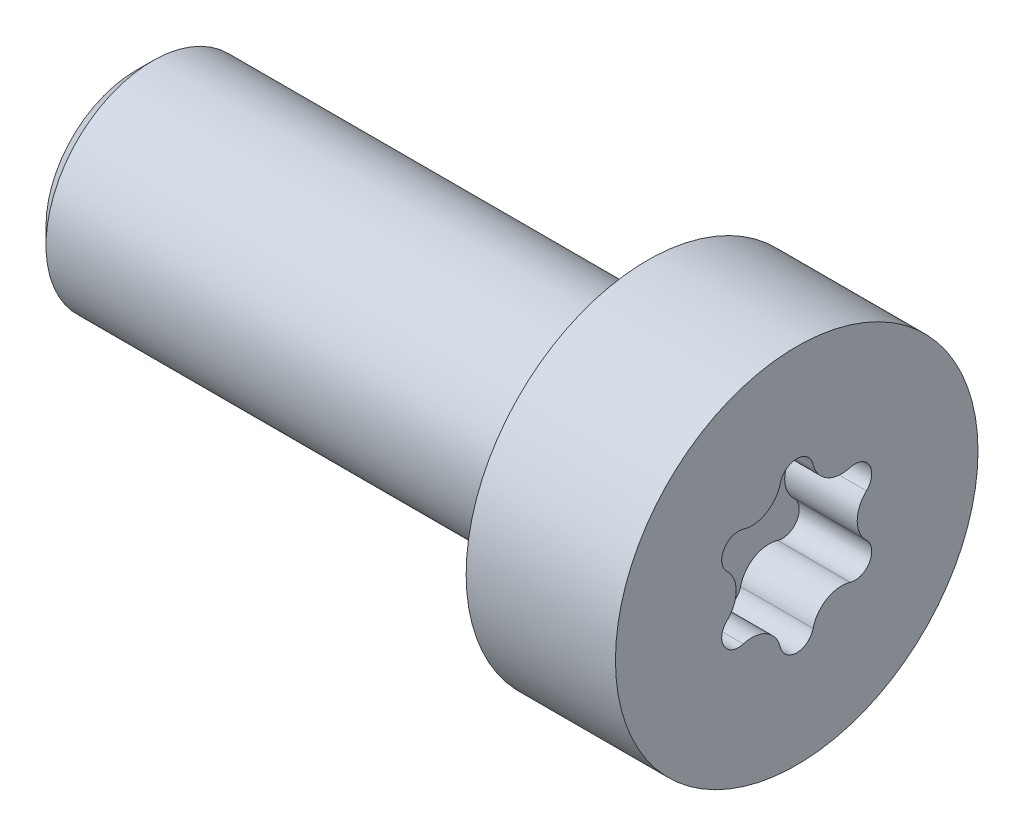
ISO-10303-21;
HEADER;
FILE_DESCRIPTION(('STEP AP214'),'2;1');
FILE_NAME('part.step','',(''),(''),'','','');
FILE_SCHEMA(('AUTOMOTIVE_DESIGN { 1 0 10303 214 1 1 1 1 }'));
ENDSEC;
DATA;
#1=APPLICATION_CONTEXT('core data for automotive mechanical design processes');
#2=APPLICATION_PROTOCOL_DEFINITION('international standard','automotive_design',2000,#1);
#3=PRODUCT_CONTEXT('',#1,'mechanical');
#4=PRODUCT('Part','Part','',(#3));
#5=PRODUCT_RELATED_PRODUCT_CATEGORY('part','',(#4));
#6=PRODUCT_DEFINITION_FORMATION('','',#4);
#7=PRODUCT_DEFINITION_CONTEXT('part definition',#1,'design');
#8=PRODUCT_DEFINITION('design','',#6,#7);
#9=PRODUCT_DEFINITION_SHAPE('','',#8);
#10=(LENGTH_UNIT() NAMED_UNIT(*) SI_UNIT(.MILLI.,.METRE.));
#11=(NAMED_UNIT(*) PLANE_ANGLE_UNIT() SI_UNIT($,.RADIAN.));
#12=(NAMED_UNIT(*) SI_UNIT($,.STERADIAN.) SOLID_ANGLE_UNIT());
#13=UNCERTAINTY_MEASURE_WITH_UNIT(LENGTH_MEASURE(1.E-05),#10,'distance_accuracy_value','');
#14=(GEOMETRIC_REPRESENTATION_CONTEXT(3) GLOBAL_UNCERTAINTY_ASSIGNED_CONTEXT((#13)) GLOBAL_UNIT_ASSIGNED_CONTEXT((#10,
#11,#12)) REPRESENTATION_CONTEXT('',''));
#15=CARTESIAN_POINT('',(0.,0.,0.));
#16=DIRECTION('',(0.,0.,1.));
#17=DIRECTION('',(1.,0.,0.));
#18=AXIS2_PLACEMENT_3D('',#15,#16,#17);
#19=CARTESIAN_POINT('',(66.415045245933,6.95788386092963,-16.0407398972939));
#20=DIRECTION('',(1.,0.,0.));
#21=DIRECTION('',(0.,0.,-1.));
#22=AXIS2_PLACEMENT_3D('',#19,#20,#21);
#23=CYLINDRICAL_SURFACE('',#22,0.394);
#24=CARTESIAN_POINT('',(46.8,6.95788386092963,-16.0407398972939));
#25=DIRECTION('',(1.,0.,0.));
#26=DIRECTION('',(0.,0.,-1.));
#27=AXIS2_PLACEMENT_3D('',#24,#25,#26);
#28=CIRCLE('',#27,0.394);
#29=CARTESIAN_POINT('',(46.8,6.58056824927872,-15.9272985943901));
#30=VERTEX_POINT('',#29);
#31=CARTESIAN_POINT('',(46.8,7.24478471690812,-16.3107841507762));
#32=VERTEX_POINT('',#31);
#33=EDGE_CURVE('E120',#30,#32,#28,.T.);
#34=ORIENTED_EDGE('',*,*,#33,.F.);
#35=DIRECTION('',(1.,0.,0.));
#36=VECTOR('',#35,1.);
#37=CARTESIAN_POINT('',(66.415045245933,6.58056824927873,-15.9272985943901));
#38=LINE('',#37,#36);
#39=CARTESIAN_POINT('',(48.5,6.58056824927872,-15.9272985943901));
#40=VERTEX_POINT('',#39);
#41=EDGE_CURVE('E119',#40,#30,#38,.F.);
#42=ORIENTED_EDGE('',*,*,#41,.F.);
#43=CARTESIAN_POINT('',(48.5,6.95788386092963,-16.0407398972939));
#44=DIRECTION('',(1.,0.,0.));
#45=DIRECTION('',(0.,0.,-1.));
#46=AXIS2_PLACEMENT_3D('',#43,#44,#45);
#47=CIRCLE('',#46,0.394);
#48=CARTESIAN_POINT('',(48.5,7.24478471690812,-16.3107841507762));
#49=VERTEX_POINT('',#48);
#50=EDGE_CURVE('E21',#49,#40,#47,.F.);
#51=ORIENTED_EDGE('',*,*,#50,.F.);
#52=DIRECTION('',(1.,0.,0.));
#53=VECTOR('',#52,1.);
#54=CARTESIAN_POINT('',(66.415045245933,7.24478471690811,-16.3107841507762));
#55=LINE('',#54,#53);
#56=EDGE_CURVE('E125',#32,#49,#55,.T.);
#57=ORIENTED_EDGE('',*,*,#56,.F.);
#58=EDGE_LOOP('',(#34,#42,#51,#57));
#59=FACE_BOUND('',#58,.T.);
#60=ADVANCED_FACE('F17',(#59),#23,.F.);
#61=CARTESIAN_POINT('',(66.415045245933,6.16988386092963,-14.6758838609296));
#62=DIRECTION('',(1.,0.,0.));
#63=DIRECTION('',(0.,0.,-1.));
#64=AXIS2_PLACEMENT_3D('',#61,#62,#63);
#65=CYLINDRICAL_SURFACE('',#64,0.394);
#66=CARTESIAN_POINT('',(46.8,6.16988386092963,-14.6758838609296));
#67=DIRECTION('',(1.,0.,0.));
#68=DIRECTION('',(0.,0.,-1.));
#69=AXIS2_PLACEMENT_3D('',#66,#67,#68);
#70=CIRCLE('',#69,0.394);
#71=CARTESIAN_POINT('',(46.8,6.07946910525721,-14.2923983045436));
#72=VERTEX_POINT('',#71);
#73=CARTESIAN_POINT('',(46.8,6.07946910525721,-15.0593694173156));
#74=VERTEX_POINT('',#73);
#75=EDGE_CURVE('E164',#72,#74,#70,.T.);
#76=ORIENTED_EDGE('',*,*,#75,.F.);
#77=DIRECTION('',(1.,0.,0.));
#78=VECTOR('',#77,1.);
#79=CARTESIAN_POINT('',(66.415045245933,6.07946910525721,-14.2923983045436));
#80=LINE('',#79,#78);
#81=CARTESIAN_POINT('',(48.5,6.07946910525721,-14.2923983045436));
#82=VERTEX_POINT('',#81);
#83=EDGE_CURVE('E159',#82,#72,#80,.F.);
#84=ORIENTED_EDGE('',*,*,#83,.F.);
#85=CARTESIAN_POINT('',(48.5,6.16988386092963,-14.6758838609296));
#86=DIRECTION('',(1.,0.,0.));
#87=DIRECTION('',(0.,0.,-1.));
#88=AXIS2_PLACEMENT_3D('',#85,#86,#87);
#89=CIRCLE('',#88,0.394);
#90=CARTESIAN_POINT('',(48.5,6.07946910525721,-15.0593694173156));
#91=VERTEX_POINT('',#90);
#92=EDGE_CURVE('E117',#91,#82,#89,.F.);
#93=ORIENTED_EDGE('',*,*,#92,.F.);
#94=DIRECTION('',(1.,0.,0.));
#95=VECTOR('',#94,1.);
#96=CARTESIAN_POINT('',(66.415045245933,6.0794691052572,-15.0593694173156));
#97=LINE('',#96,#95);
#98=EDGE_CURVE('E130',#74,#91,#97,.T.);
#99=ORIENTED_EDGE('',*,*,#98,.F.);
#100=EDGE_LOOP('',(#76,#84,#93,#99));
#101=FACE_BOUND('',#100,.T.);
#102=ADVANCED_FACE('F182',(#101),#65,.F.);
#103=CARTESIAN_POINT('',(66.415045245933,6.95788386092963,-13.3110278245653));
#104=DIRECTION('',(1.,0.,0.));
#105=DIRECTION('',(0.,0.,-1.));
#106=AXIS2_PLACEMENT_3D('',#103,#104,#105);
#107=CYLINDRICAL_SURFACE('',#106,0.394);
#108=CARTESIAN_POINT('',(46.8,6.95788386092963,-13.3110278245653));
#109=DIRECTION('',(1.,0.,0.));
#110=DIRECTION('',(0.,0.,-1.));
#111=AXIS2_PLACEMENT_3D('',#108,#109,#110);
#112=CIRCLE('',#111,0.394);
#113=CARTESIAN_POINT('',(46.8,7.24478471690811,-13.040983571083));
#114=VERTEX_POINT('',#113);
#115=CARTESIAN_POINT('',(46.8,6.58056824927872,-13.4244691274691));
#116=VERTEX_POINT('',#115);
#117=EDGE_CURVE('E166',#114,#116,#112,.T.);
#118=ORIENTED_EDGE('',*,*,#117,.F.);
#119=DIRECTION('',(1.,0.,0.));
#120=VECTOR('',#119,1.);
#121=CARTESIAN_POINT('',(66.415045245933,7.2447847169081,-13.040983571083));
#122=LINE('',#121,#120);
#123=CARTESIAN_POINT('',(48.5,7.24478471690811,-13.040983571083));
#124=VERTEX_POINT('',#123);
#125=EDGE_CURVE('E154',#124,#114,#122,.F.);
#126=ORIENTED_EDGE('',*,*,#125,.F.);
#127=CARTESIAN_POINT('',(48.5,6.95788386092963,-13.3110278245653));
#128=DIRECTION('',(1.,0.,0.));
#129=DIRECTION('',(0.,0.,-1.));
#130=AXIS2_PLACEMENT_3D('',#127,#128,#129);
#131=CIRCLE('',#130,0.394);
#132=CARTESIAN_POINT('',(48.5,6.58056824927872,-13.4244691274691));
#133=VERTEX_POINT('',#132);
#134=EDGE_CURVE('E177',#133,#124,#131,.F.);
#135=ORIENTED_EDGE('',*,*,#134,.F.);
#136=DIRECTION('',(1.,0.,0.));
#137=VECTOR('',#136,1.);
#138=CARTESIAN_POINT('',(66.415045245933,6.58056824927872,-13.4244691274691));
#139=LINE('',#138,#137);
#140=EDGE_CURVE('E158',#116,#133,#139,.T.);
#141=ORIENTED_EDGE('',*,*,#140,.F.);
#142=EDGE_LOOP('',(#118,#126,#135,#141));
#143=FACE_BOUND('',#142,.T.);
#144=ADVANCED_FACE('F255',(#143),#107,.F.);
#145=CARTESIAN_POINT('',(66.415045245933,8.53388386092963,-13.3110278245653));
#146=DIRECTION('',(1.,0.,0.));
#147=DIRECTION('',(0.,0.,-1.));
#148=AXIS2_PLACEMENT_3D('',#145,#146,#147);
#149=CYLINDRICAL_SURFACE('',#148,0.394);
#150=CARTESIAN_POINT('',(46.8,8.53388386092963,-13.3110278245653));
#151=DIRECTION('',(1.,0.,0.));
#152=DIRECTION('',(0.,0.,-1.));
#153=AXIS2_PLACEMENT_3D('',#150,#151,#152);
#154=CIRCLE('',#153,0.394);
#155=CARTESIAN_POINT('',(46.8,8.91119947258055,-13.424469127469));
#156=VERTEX_POINT('',#155);
#157=CARTESIAN_POINT('',(46.8,8.24698300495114,-13.040983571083));
#158=VERTEX_POINT('',#157);
#159=EDGE_CURVE('E168',#156,#158,#154,.T.);
#160=ORIENTED_EDGE('',*,*,#159,.F.);
#161=DIRECTION('',(1.,0.,0.));
#162=VECTOR('',#161,1.);
#163=CARTESIAN_POINT('',(66.415045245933,8.91119947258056,-13.424469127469));
#164=LINE('',#163,#162);
#165=CARTESIAN_POINT('',(48.5,8.91119947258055,-13.424469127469));
#166=VERTEX_POINT('',#165);
#167=EDGE_CURVE('E149',#166,#156,#164,.F.);
#168=ORIENTED_EDGE('',*,*,#167,.F.);
#169=CARTESIAN_POINT('',(48.5,8.53388386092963,-13.3110278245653));
#170=DIRECTION('',(1.,0.,0.));
#171=DIRECTION('',(0.,0.,-1.));
#172=AXIS2_PLACEMENT_3D('',#169,#170,#171);
#173=CIRCLE('',#172,0.394);
#174=CARTESIAN_POINT('',(48.5,8.24698300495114,-13.040983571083));
#175=VERTEX_POINT('',#174);
#176=EDGE_CURVE('E175',#175,#166,#173,.F.);
#177=ORIENTED_EDGE('',*,*,#176,.F.);
#178=DIRECTION('',(1.,0.,0.));
#179=VECTOR('',#178,1.);
#180=CARTESIAN_POINT('',(66.415045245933,8.24698300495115,-13.040983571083));
#181=LINE('',#180,#179);
#182=EDGE_CURVE('E153',#158,#175,#181,.T.);
#183=ORIENTED_EDGE('',*,*,#182,.F.);
#184=EDGE_LOOP('',(#160,#168,#177,#183));
#185=FACE_BOUND('',#184,.T.);
#186=ADVANCED_FACE('F253',(#185),#149,.F.);
#187=CARTESIAN_POINT('',(66.415045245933,9.32188386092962,-14.6758838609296));
#188=DIRECTION('',(1.,0.,0.));
#189=DIRECTION('',(0.,0.,-1.));
#190=AXIS2_PLACEMENT_3D('',#187,#188,#189);
#191=CYLINDRICAL_SURFACE('',#190,0.394);
#192=CARTESIAN_POINT('',(46.8,9.32188386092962,-14.6758838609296));
#193=DIRECTION('',(1.,0.,0.));
#194=DIRECTION('',(0.,0.,-1.));
#195=AXIS2_PLACEMENT_3D('',#192,#193,#194);
#196=CIRCLE('',#195,0.394);
#197=CARTESIAN_POINT('',(46.8,9.41229861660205,-15.0593694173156));
#198=VERTEX_POINT('',#197);
#199=CARTESIAN_POINT('',(46.8,9.41229861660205,-14.2923983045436));
#200=VERTEX_POINT('',#199);
#201=EDGE_CURVE('E170',#198,#200,#196,.T.);
#202=ORIENTED_EDGE('',*,*,#201,.F.);
#203=DIRECTION('',(1.,0.,0.));
#204=VECTOR('',#203,1.);
#205=CARTESIAN_POINT('',(66.415045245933,9.41229861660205,-15.0593694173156));
#206=LINE('',#205,#204);
#207=CARTESIAN_POINT('',(48.5,9.41229861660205,-15.0593694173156));
#208=VERTEX_POINT('',#207);
#209=EDGE_CURVE('E144',#208,#198,#206,.F.);
#210=ORIENTED_EDGE('',*,*,#209,.F.);
#211=CARTESIAN_POINT('',(48.5,9.32188386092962,-14.6758838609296));
#212=DIRECTION('',(1.,0.,0.));
#213=DIRECTION('',(0.,0.,-1.));
#214=AXIS2_PLACEMENT_3D('',#211,#212,#213);
#215=CIRCLE('',#214,0.394);
#216=CARTESIAN_POINT('',(48.5,9.41229861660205,-14.2923983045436));
#217=VERTEX_POINT('',#216);
#218=EDGE_CURVE('E173',#217,#208,#215,.F.);
#219=ORIENTED_EDGE('',*,*,#218,.F.);
#220=DIRECTION('',(1.,0.,0.));
#221=VECTOR('',#220,1.);
#222=CARTESIAN_POINT('',(66.415045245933,9.41229861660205,-14.2923983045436));
#223=LINE('',#222,#221);
#224=EDGE_CURVE('E148',#200,#217,#223,.T.);
#225=ORIENTED_EDGE('',*,*,#224,.F.);
#226=EDGE_LOOP('',(#202,#210,#219,#225));
#227=FACE_BOUND('',#226,.T.);
#228=ADVANCED_FACE('F247',(#227),#191,.F.);
#229=CARTESIAN_POINT('',(46.8,7.35188386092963,-16.4115907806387));
#230=DIRECTION('',(1.,0.,0.));
#231=DIRECTION('',(0.,0.,-1.));
#232=AXIS2_PLACEMENT_3D('',#229,#230,#231);
#233=PLANE('',#232);
#234=ORIENTED_EDGE('',*,*,#75,.T.);
#235=CARTESIAN_POINT('',(46.8,5.92155128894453,-15.7291627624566));
#236=DIRECTION('',(1.,0.,0.));
#237=DIRECTION('',(0.,0.,-1.));
#238=AXIS2_PLACEMENT_3D('',#235,#236,#237);
#239=CIRCLE('',#238,0.688157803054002);
#240=EDGE_CURVE('E124',#30,#74,#239,.T.);
#241=ORIENTED_EDGE('',*,*,#240,.F.);
#242=ORIENTED_EDGE('',*,*,#33,.T.);
#243=CARTESIAN_POINT('',(46.8,7.74588386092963,-16.7824416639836));
#244=DIRECTION('',(1.,0.,0.));
#245=DIRECTION('',(0.,0.,-1.));
#246=AXIS2_PLACEMENT_3D('',#243,#244,#245);
#247=CIRCLE('',#246,0.688157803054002);
#248=CARTESIAN_POINT('',(46.8,8.24698300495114,-16.3107841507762));
#249=VERTEX_POINT('',#248);
#250=EDGE_CURVE('E161',#249,#32,#247,.T.);
#251=ORIENTED_EDGE('',*,*,#250,.F.);
#252=CARTESIAN_POINT('',(46.8,8.53388386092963,-16.0407398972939));
#253=DIRECTION('',(1.,0.,0.));
#254=DIRECTION('',(0.,0.,-1.));
#255=AXIS2_PLACEMENT_3D('',#252,#253,#254);
#256=CIRCLE('',#255,0.394);
#257=CARTESIAN_POINT('',(46.8,8.91119947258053,-15.9272985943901));
#258=VERTEX_POINT('',#257);
#259=EDGE_CURVE('E139',#249,#258,#256,.T.);
#260=ORIENTED_EDGE('',*,*,#259,.T.);
#261=CARTESIAN_POINT('',(46.8,9.57021643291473,-15.7291627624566));
#262=DIRECTION('',(1.,0.,0.));
#263=DIRECTION('',(0.,0.,-1.));
#264=AXIS2_PLACEMENT_3D('',#261,#262,#263);
#265=CIRCLE('',#264,0.688157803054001);
#266=EDGE_CURVE('E142',#198,#258,#265,.T.);
#267=ORIENTED_EDGE('',*,*,#266,.F.);
#268=ORIENTED_EDGE('',*,*,#201,.T.);
#269=CARTESIAN_POINT('',(46.8,9.57021643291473,-13.6226049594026));
#270=DIRECTION('',(1.,0.,0.));
#271=DIRECTION('',(0.,0.,-1.));
#272=AXIS2_PLACEMENT_3D('',#269,#270,#271);
#273=CIRCLE('',#272,0.688157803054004);
#274=EDGE_CURVE('E145',#156,#200,#273,.T.);
#275=ORIENTED_EDGE('',*,*,#274,.F.);
#276=ORIENTED_EDGE('',*,*,#159,.T.);
#277=CARTESIAN_POINT('',(46.8,7.74588386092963,-12.5693260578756));
#278=DIRECTION('',(1.,0.,0.));
#279=DIRECTION('',(0.,0.,-1.));
#280=AXIS2_PLACEMENT_3D('',#277,#278,#279);
#281=CIRCLE('',#280,0.688157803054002);
#282=EDGE_CURVE('E150',#114,#158,#281,.T.);
#283=ORIENTED_EDGE('',*,*,#282,.F.);
#284=ORIENTED_EDGE('',*,*,#117,.T.);
#285=CARTESIAN_POINT('',(46.8,5.92155128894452,-13.6226049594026));
#286=DIRECTION('',(1.,0.,0.));
#287=DIRECTION('',(0.,0.,-1.));
#288=AXIS2_PLACEMENT_3D('',#285,#286,#287);
#289=CIRCLE('',#288,0.688157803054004);
#290=EDGE_CURVE('E155',#72,#116,#289,.T.);
#291=ORIENTED_EDGE('',*,*,#290,.F.);
#292=EDGE_LOOP('',(#234,#241,#242,#251,#260,#267,#268,#275,#276,#283,#284,#291));
#293=FACE_BOUND('',#292,.T.);
#294=ADVANCED_FACE('F243',(#293),#233,.T.);
#295=CARTESIAN_POINT('',(66.415045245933,7.74588386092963,-16.7824416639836));
#296=DIRECTION('',(1.,0.,0.));
#297=DIRECTION('',(0.,0.,-1.));
#298=AXIS2_PLACEMENT_3D('',#295,#296,#297);
#299=CYLINDRICAL_SURFACE('',#298,0.688157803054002);
#300=ORIENTED_EDGE('',*,*,#56,.T.);
#301=CARTESIAN_POINT('',(48.5,7.74588386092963,-16.7824416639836));
#302=DIRECTION('',(1.,0.,0.));
#303=DIRECTION('',(0.,0.,-1.));
#304=AXIS2_PLACEMENT_3D('',#301,#302,#303);
#305=CIRCLE('',#304,0.688157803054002);
#306=CARTESIAN_POINT('',(48.5,8.24698300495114,-16.3107841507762));
#307=VERTEX_POINT('',#306);
#308=EDGE_CURVE('E116',#307,#49,#305,.T.);
#309=ORIENTED_EDGE('',*,*,#308,.F.);
#310=DIRECTION('',(1.,0.,0.));
#311=VECTOR('',#310,1.);
#312=CARTESIAN_POINT('',(66.415045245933,8.24698300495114,-16.3107841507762));
#313=LINE('',#312,#311);
#314=EDGE_CURVE('E141',#307,#249,#313,.F.);
#315=ORIENTED_EDGE('',*,*,#314,.T.);
#316=ORIENTED_EDGE('',*,*,#250,.T.);
#317=EDGE_LOOP('',(#300,#309,#315,#316));
#318=FACE_BOUND('',#317,.T.);
#319=ADVANCED_FACE('F238',(#318),#299,.T.);
#320=CARTESIAN_POINT('',(66.415045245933,5.92155128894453,-15.7291627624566));
#321=DIRECTION('',(1.,0.,0.));
#322=DIRECTION('',(0.,0.,-1.));
#323=AXIS2_PLACEMENT_3D('',#320,#321,#322);
#324=CYLINDRICAL_SURFACE('',#323,0.688157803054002);
#325=ORIENTED_EDGE('',*,*,#98,.T.);
#326=CARTESIAN_POINT('',(48.5,5.92155128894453,-15.7291627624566));
#327=DIRECTION('',(1.,0.,0.));
#328=DIRECTION('',(0.,0.,-1.));
#329=AXIS2_PLACEMENT_3D('',#326,#327,#328);
#330=CIRCLE('',#329,0.688157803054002);
#331=EDGE_CURVE('E114',#40,#91,#330,.T.);
#332=ORIENTED_EDGE('',*,*,#331,.F.);
#333=ORIENTED_EDGE('',*,*,#41,.T.);
#334=ORIENTED_EDGE('',*,*,#240,.T.);
#335=EDGE_LOOP('',(#325,#332,#333,#334));
#336=FACE_BOUND('',#335,.T.);
#337=ADVANCED_FACE('F128',(#336),#324,.T.);
#338=CARTESIAN_POINT('',(66.415045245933,5.92155128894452,-13.6226049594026));
#339=DIRECTION('',(1.,0.,0.));
#340=DIRECTION('',(0.,0.,-1.));
#341=AXIS2_PLACEMENT_3D('',#338,#339,#340);
#342=CYLINDRICAL_SURFACE('',#341,0.688157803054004);
#343=ORIENTED_EDGE('',*,*,#140,.T.);
#344=CARTESIAN_POINT('',(48.5,5.92155128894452,-13.6226049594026));
#345=DIRECTION('',(1.,0.,0.));
#346=DIRECTION('',(0.,0.,-1.));
#347=AXIS2_PLACEMENT_3D('',#344,#345,#346);
#348=CIRCLE('',#347,0.688157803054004);
#349=EDGE_CURVE('E131',#82,#133,#348,.T.);
#350=ORIENTED_EDGE('',*,*,#349,.F.);
#351=ORIENTED_EDGE('',*,*,#83,.T.);
#352=ORIENTED_EDGE('',*,*,#290,.T.);
#353=EDGE_LOOP('',(#343,#350,#351,#352));
#354=FACE_BOUND('',#353,.T.);
#355=ADVANCED_FACE('F187',(#354),#342,.T.);
#356=CARTESIAN_POINT('',(66.415045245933,7.74588386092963,-12.5693260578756));
#357=DIRECTION('',(1.,0.,0.));
#358=DIRECTION('',(0.,0.,-1.));
#359=AXIS2_PLACEMENT_3D('',#356,#357,#358);
#360=CYLINDRICAL_SURFACE('',#359,0.688157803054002);
#361=ORIENTED_EDGE('',*,*,#182,.T.);
#362=CARTESIAN_POINT('',(48.5,7.74588386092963,-12.5693260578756));
#363=DIRECTION('',(1.,0.,0.));
#364=DIRECTION('',(0.,0.,-1.));
#365=AXIS2_PLACEMENT_3D('',#362,#363,#364);
#366=CIRCLE('',#365,0.688157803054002);
#367=EDGE_CURVE('E134',#124,#175,#366,.T.);
#368=ORIENTED_EDGE('',*,*,#367,.F.);
#369=ORIENTED_EDGE('',*,*,#125,.T.);
#370=ORIENTED_EDGE('',*,*,#282,.T.);
#371=EDGE_LOOP('',(#361,#368,#369,#370));
#372=FACE_BOUND('',#371,.T.);
#373=ADVANCED_FACE('F220',(#372),#360,.T.);
#374=CARTESIAN_POINT('',(66.415045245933,9.57021643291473,-13.6226049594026));
#375=DIRECTION('',(1.,0.,0.));
#376=DIRECTION('',(0.,0.,-1.));
#377=AXIS2_PLACEMENT_3D('',#374,#375,#376);
#378=CYLINDRICAL_SURFACE('',#377,0.688157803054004);
#379=ORIENTED_EDGE('',*,*,#224,.T.);
#380=CARTESIAN_POINT('',(48.5,9.57021643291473,-13.6226049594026));
#381=DIRECTION('',(1.,0.,0.));
#382=DIRECTION('',(0.,0.,-1.));
#383=AXIS2_PLACEMENT_3D('',#380,#381,#382);
#384=CIRCLE('',#383,0.688157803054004);
#385=EDGE_CURVE('E212',#166,#217,#384,.T.);
#386=ORIENTED_EDGE('',*,*,#385,.F.);
#387=ORIENTED_EDGE('',*,*,#167,.T.);
#388=ORIENTED_EDGE('',*,*,#274,.T.);
#389=EDGE_LOOP('',(#379,#386,#387,#388));
#390=FACE_BOUND('',#389,.T.);
#391=ADVANCED_FACE('F252',(#390),#378,.T.);
#392=CARTESIAN_POINT('',(66.415045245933,9.57021643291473,-15.7291627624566));
#393=DIRECTION('',(1.,0.,0.));
#394=DIRECTION('',(0.,0.,-1.));
#395=AXIS2_PLACEMENT_3D('',#392,#393,#394);
#396=CYLINDRICAL_SURFACE('',#395,0.688157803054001);
#397=DIRECTION('',(1.,0.,0.));
#398=VECTOR('',#397,1.);
#399=CARTESIAN_POINT('',(66.415045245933,8.91119947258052,-15.9272985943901));
#400=LINE('',#399,#398);
#401=CARTESIAN_POINT('',(48.5,8.91119947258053,-15.9272985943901));
#402=VERTEX_POINT('',#401);
#403=EDGE_CURVE('E36',#258,#402,#400,.T.);
#404=ORIENTED_EDGE('',*,*,#403,.T.);
#405=CARTESIAN_POINT('',(48.5,9.57021643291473,-15.7291627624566));
#406=DIRECTION('',(1.,0.,0.));
#407=DIRECTION('',(0.,0.,-1.));
#408=AXIS2_PLACEMENT_3D('',#405,#406,#407);
#409=CIRCLE('',#408,0.688157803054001);
#410=EDGE_CURVE('E210',#208,#402,#409,.T.);
#411=ORIENTED_EDGE('',*,*,#410,.F.);
#412=ORIENTED_EDGE('',*,*,#209,.T.);
#413=ORIENTED_EDGE('',*,*,#266,.T.);
#414=EDGE_LOOP('',(#404,#411,#412,#413));
#415=FACE_BOUND('',#414,.T.);
#416=ADVANCED_FACE('F244',(#415),#396,.T.);
#417=CARTESIAN_POINT('',(66.415045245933,8.53388386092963,-16.0407398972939));
#418=DIRECTION('',(1.,0.,0.));
#419=DIRECTION('',(0.,0.,-1.));
#420=AXIS2_PLACEMENT_3D('',#417,#418,#419);
#421=CYLINDRICAL_SURFACE('',#420,0.394);
#422=ORIENTED_EDGE('',*,*,#259,.F.);
#423=ORIENTED_EDGE('',*,*,#314,.F.);
#424=CARTESIAN_POINT('',(48.5,8.53388386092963,-16.0407398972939));
#425=DIRECTION('',(1.,0.,0.));
#426=DIRECTION('',(0.,0.,-1.));
#427=AXIS2_PLACEMENT_3D('',#424,#425,#426);
#428=CIRCLE('',#427,0.394);
#429=EDGE_CURVE('E208',#402,#307,#428,.F.);
#430=ORIENTED_EDGE('',*,*,#429,.F.);
#431=ORIENTED_EDGE('',*,*,#403,.F.);
#432=EDGE_LOOP('',(#422,#423,#430,#431));
#433=FACE_BOUND('',#432,.T.);
#434=ADVANCED_FACE('F240',(#433),#421,.F.);
#435=CARTESIAN_POINT('',(48.5,7.74588386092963,-14.6758838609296));
#436=DIRECTION('',(1.,0.,0.));
#437=DIRECTION('',(0.,0.,-1.));
#438=AXIS2_PLACEMENT_3D('',#435,#436,#437);
#439=PLANE('',#438);
#440=ORIENTED_EDGE('',*,*,#410,.T.);
#441=ORIENTED_EDGE('',*,*,#429,.T.);
#442=ORIENTED_EDGE('',*,*,#308,.T.);
#443=ORIENTED_EDGE('',*,*,#50,.T.);
#444=ORIENTED_EDGE('',*,*,#331,.T.);
#445=ORIENTED_EDGE('',*,*,#92,.T.);
#446=ORIENTED_EDGE('',*,*,#349,.T.);
#447=ORIENTED_EDGE('',*,*,#134,.T.);
#448=ORIENTED_EDGE('',*,*,#367,.T.);
#449=ORIENTED_EDGE('',*,*,#176,.T.);
#450=ORIENTED_EDGE('',*,*,#385,.T.);
#451=ORIENTED_EDGE('',*,*,#218,.T.);
#452=EDGE_LOOP('',(#440,#441,#442,#443,#444,#445,#446,#447,#448,#449,#450,#451));
#453=FACE_BOUND('',#452,.T.);
#454=CARTESIAN_POINT('',(48.5,7.74588386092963,-14.6758838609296));
#455=DIRECTION('',(-1.,0.,0.));
#456=DIRECTION('',(0.,0.,1.));
#457=AXIS2_PLACEMENT_3D('',#454,#455,#456);
#458=CIRCLE('',#457,4.25);
#459=CARTESIAN_POINT('',(48.5,7.74588386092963,-10.4258838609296));
#460=VERTEX_POINT('',#459);
#461=EDGE_CURVE('E205',#460,#460,#458,.T.);
#462=ORIENTED_EDGE('',*,*,#461,.F.);
#463=EDGE_LOOP('',(#462));
#464=FACE_BOUND('',#463,.T.);
#465=ADVANCED_FACE('F111',(#453,#464),#439,.T.);
#466=CARTESIAN_POINT('',(45.,7.74588386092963,-14.6758838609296));
#467=DIRECTION('',(-1.,0.,0.));
#468=DIRECTION('',(0.,0.,1.));
#469=AXIS2_PLACEMENT_3D('',#466,#467,#468);
#470=CYLINDRICAL_SURFACE('',#469,4.25);
#471=CARTESIAN_POINT('',(45.,7.74588386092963,-14.6758838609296));
#472=DIRECTION('',(-1.,0.,0.));
#473=DIRECTION('',(0.,0.,1.));
#474=AXIS2_PLACEMENT_3D('',#471,#472,#473);
#475=CIRCLE('',#474,4.25);
#476=CARTESIAN_POINT('',(45.,7.74588386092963,-10.4258838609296));
#477=VERTEX_POINT('',#476);
#478=EDGE_CURVE('E202',#477,#477,#475,.T.);
#479=ORIENTED_EDGE('',*,*,#478,.F.);
#480=EDGE_LOOP('',(#479));
#481=FACE_BOUND('',#480,.T.);
#482=ORIENTED_EDGE('',*,*,#461,.T.);
#483=EDGE_LOOP('',(#482));
#484=FACE_BOUND('',#483,.T.);
#485=ADVANCED_FACE('F282',(#481,#484),#470,.T.);
#486=CARTESIAN_POINT('',(33.,7.74588386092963,-14.6758838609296));
#487=DIRECTION('',(1.,0.,0.));
#488=DIRECTION('',(0.,0.,-1.));
#489=AXIS2_PLACEMENT_3D('',#486,#487,#488);
#490=PLANE('',#489);
#491=CARTESIAN_POINT('',(33.0000000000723,7.74588386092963,-14.6758838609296));
#492=DIRECTION('',(1.,0.,0.));
#493=DIRECTION('',(0.,0.,-1.));
#494=AXIS2_PLACEMENT_3D('',#491,#492,#493);
#495=CIRCLE('',#494,2.10000000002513);
#496=CARTESIAN_POINT('',(33.0000000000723,7.74588386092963,-16.7758838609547));
#497=VERTEX_POINT('',#496);
#498=EDGE_CURVE('E199',#497,#497,#495,.T.);
#499=ORIENTED_EDGE('',*,*,#498,.F.);
#500=EDGE_LOOP('',(#499));
#501=FACE_BOUND('',#500,.T.);
#502=ADVANCED_FACE('F278',(#501),#490,.F.);
#503=CARTESIAN_POINT('',(45.,7.74588386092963,-14.6758838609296));
#504=DIRECTION('',(-1.,0.,0.));
#505=DIRECTION('',(0.,0.,1.));
#506=AXIS2_PLACEMENT_3D('',#503,#504,#505);
#507=PLANE('',#506);
#508=CARTESIAN_POINT('',(45.,7.74588386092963,-14.6758838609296));
#509=DIRECTION('',(1.,0.,0.));
#510=DIRECTION('',(0.,0.,-1.));
#511=AXIS2_PLACEMENT_3D('',#508,#509,#510);
#512=CIRCLE('',#511,2.5);
#513=CARTESIAN_POINT('',(45.,7.74588386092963,-17.1758838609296));
#514=VERTEX_POINT('',#513);
#515=EDGE_CURVE('E27',#514,#514,#512,.F.);
#516=ORIENTED_EDGE('',*,*,#515,.F.);
#517=EDGE_LOOP('',(#516));
#518=FACE_BOUND('',#517,.T.);
#519=ORIENTED_EDGE('',*,*,#478,.T.);
#520=EDGE_LOOP('',(#519));
#521=FACE_BOUND('',#520,.T.);
#522=ADVANCED_FACE('F270',(#518,#521),#507,.T.);
#523=CARTESIAN_POINT('',(33.4000000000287,7.74588386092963,-14.6758838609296));
#524=DIRECTION('',(1.,0.,0.));
#525=DIRECTION('',(0.,0.,-1.));
#526=AXIS2_PLACEMENT_3D('',#523,#524,#525);
#527=CONICAL_SURFACE('',#526,2.49999999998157,0.785398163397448);
#528=CARTESIAN_POINT('',(33.4,7.74588386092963,-14.6758838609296));
#529=DIRECTION('',(1.,0.,0.));
#530=DIRECTION('',(0.,0.,-1.));
#531=AXIS2_PLACEMENT_3D('',#528,#529,#530);
#532=CIRCLE('',#531,2.5);
#533=CARTESIAN_POINT('',(33.4,7.74588386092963,-17.1758838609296));
#534=VERTEX_POINT('',#533);
#535=EDGE_CURVE('E11',#534,#534,#532,.T.);
#536=ORIENTED_EDGE('',*,*,#535,.F.);
#537=EDGE_LOOP('',(#536));
#538=FACE_BOUND('',#537,.T.);
#539=ORIENTED_EDGE('',*,*,#498,.T.);
#540=EDGE_LOOP('',(#539));
#541=FACE_BOUND('',#540,.T.);
#542=ADVANCED_FACE('F265',(#538,#541),#527,.T.);
#543=CARTESIAN_POINT('',(52.615045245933,7.74588386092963,-14.6758838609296));
#544=DIRECTION('',(1.,0.,0.));
#545=DIRECTION('',(0.,0.,-1.));
#546=AXIS2_PLACEMENT_3D('',#543,#544,#545);
#547=CYLINDRICAL_SURFACE('',#546,2.5);
#548=ORIENTED_EDGE('',*,*,#535,.T.);
#549=EDGE_LOOP('',(#548));
#550=FACE_BOUND('',#549,.T.);
#551=ORIENTED_EDGE('',*,*,#515,.T.);
#552=EDGE_LOOP('',(#551));
#553=FACE_BOUND('',#552,.T.);
#554=ADVANCED_FACE('F19',(#550,#553),#547,.T.);
#555=CLOSED_SHELL('',(#60,#102,#144,#186,#228,#294,#319,#337,#355,#373,#391,#416,#434,#465,#485,
#502,#522,#542,#554));
#556=MANIFOLD_SOLID_BREP('B1',#555);
#557=ADVANCED_BREP_SHAPE_REPRESENTATION('',(#18,#556),#14);
#558=SHAPE_DEFINITION_REPRESENTATION(#9,#557);
ENDSEC;
END-ISO-10303-21;
